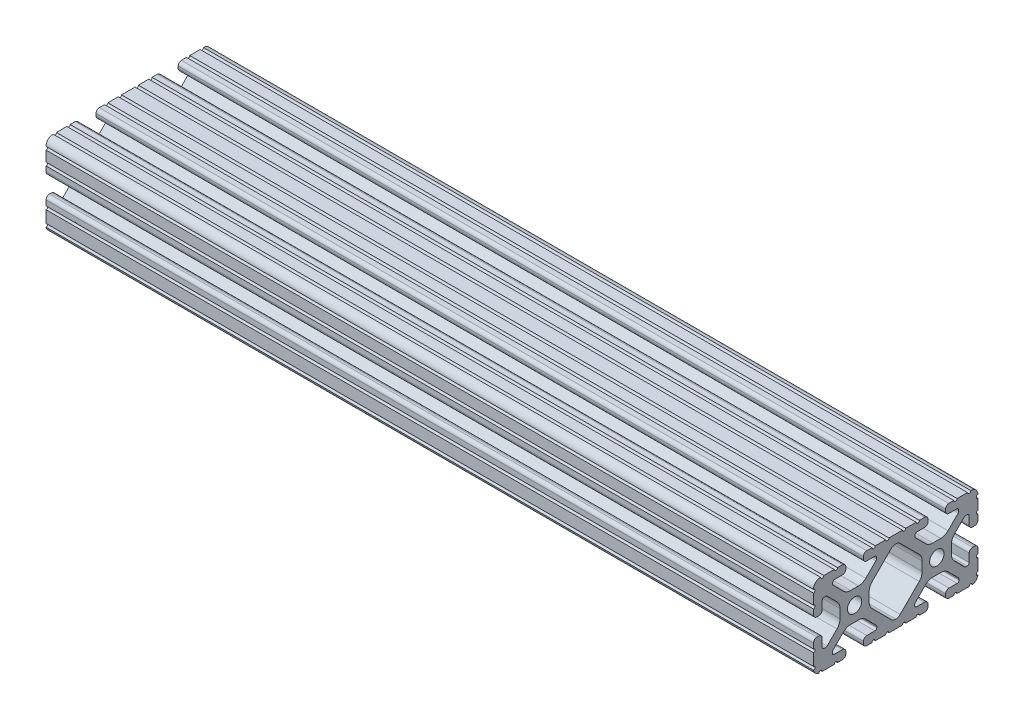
from build123d import *

# Parameters (mm, degrees)
SKETCH1_R      = 3.3274
EXTRUDE1_DEPTH = 355.6


with BuildPart() as part:
    # Sketch1 → Extrude1 (new body)
    with BuildSketch(Plane(origin=(0, 0, 0), x_dir=(0, 0, -1), z_dir=(1, 0, 0))):
        with BuildLine():
            Line((37.1900335, 54.320138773), (37.1900335, 54.882716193))
            ThreePointArc((37.1900335, 54.882716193), (37.450415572, 55.511334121), (38.0790335, 55.771716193))
            Line((38.0790335, 55.771716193), (41.685477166, 55.771716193))
            ThreePointArc((41.685477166, 55.771716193), (42.799028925, 56.232964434), (43.260277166, 57.346516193))
            Line((43.260277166, 57.346516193), (43.260277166, 58.282488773))
            ThreePointArc((43.260277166, 58.282488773), (42.805347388, 59.380786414), (41.707049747, 59.835716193))
            Line((41.707049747, 59.835716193), (39.271813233, 59.835716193))
            ThreePointArc((39.271813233, 59.835716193), (38.509813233, 59.073716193), (37.747813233, 59.835716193))
            Line((37.747813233, 59.835716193), (32.919398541, 59.835716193))
            ThreePointArc((32.919398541, 59.835716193), (32.157398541, 59.073716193), (31.395398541, 59.835716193))
            Line((31.395398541, 59.835716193), (25.153155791, 59.835716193))
            ThreePointArc((25.153155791, 59.835716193), (24.391155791, 59.073716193), (23.629155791, 59.835716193))
            Line((23.629155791, 59.835716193), (18.800741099, 59.835716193))
            ThreePointArc((18.800741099, 59.835716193), (18.038741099, 59.073716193), (17.276741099, 59.835716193))
            Line((17.276741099, 59.835716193), (14.841504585, 59.835716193))
            ThreePointArc((14.841504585, 59.835716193), (13.743206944, 59.380786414), (13.288277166, 58.282488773))
            Line((13.288277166, 58.282488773), (13.288277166, 57.346516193))
            ThreePointArc((13.288277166, 57.346516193), (13.749525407, 56.232964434), (14.863077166, 55.771716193))
            Line((14.863077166, 55.771716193), (18.469520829, 55.771716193))
            ThreePointArc((18.469520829, 55.771716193), (19.098138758, 55.511334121), (19.358520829, 54.882716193))
            Line((19.358520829, 54.882716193), (19.358520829, 54.320138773))
            ThreePointArc((19.358520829, 54.320138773), (19.290850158, 53.979934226), (19.098140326, 53.691522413))
            Line((19.098140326, 53.691522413), (14.421778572, 49.015137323))
            ThreePointArc((14.421778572, 49.015137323), (12.880829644, 47.985503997), (11.063154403, 47.623944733))
            Line((11.063154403, 47.623944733), (7.38539993, 47.623944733))
            ThreePointArc((7.38539993, 47.623944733), (5.567724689, 47.985503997), (4.026775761, 49.015137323))
            Line((4.026775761, 49.015137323), (-0.649585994, 53.691522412))
            ThreePointArc((-0.649585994, 53.691522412), (-0.842295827, 53.979934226), (-0.909966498, 54.320138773))
            Line((-0.909966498, 54.320138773), (-0.909966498, 54.882716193))
            ThreePointArc((-0.909966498, 54.882716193), (-0.649584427, 55.511334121), (-0.020966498, 55.771716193))
            Line((-0.020966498, 55.771716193), (3.585477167, 55.771716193))
            ThreePointArc((3.585477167, 55.771716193), (4.699028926, 56.232964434), (5.160277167, 57.346516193))
            Line((5.160277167, 57.346516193), (5.160277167, 58.266281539))
            ThreePointArc((5.160277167, 58.266281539), (4.744040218, 59.332924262), (3.715361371, 59.835716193))
            Line((3.715361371, 59.835716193), (1.328459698, 59.835716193))
            ThreePointArc((1.328459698, 59.835716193), (0.566459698, 59.073716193), (-0.195540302, 59.835716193))
            Line((-0.195540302, 59.835716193), (-5.021979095, 59.835716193))
            ThreePointArc((-5.021979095, 59.835716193), (-5.807035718, 59.097492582), (-6.545259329, 59.882549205))
            ThreePointArc((-6.545259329, 59.882549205), (-8.87374186, 58.977730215), (-9.863337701, 56.683993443))
            ThreePointArc((-9.863337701, 56.683993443), (-9.063955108, 55.941735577), (-9.825722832, 55.160922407))
            Line((-9.825722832, 55.160922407), (-9.825722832, 50.335417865))
            ThreePointArc((-9.825722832, 50.335417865), (-9.063722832, 49.573417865), (-9.825722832, 48.811417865))
            Line((-9.825722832, 48.811417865), (-9.825722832, 46.424516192))
            ThreePointArc((-9.825722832, 46.424516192), (-9.364474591, 45.310964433), (-8.250922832, 44.849716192))
            Line((-8.250922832, 44.849716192), (-7.336522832, 44.849716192))
            ThreePointArc((-7.336522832, 44.849716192), (-6.222971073, 45.310964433), (-5.761722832, 46.424516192))
            Line((-5.761722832, 46.424516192), (-5.761722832, 50.183716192))
            ThreePointArc((-5.761722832, 50.183716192), (-5.50134076, 50.81233412), (-4.872722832, 51.072716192))
            Line((-4.872722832, 51.072716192), (-4.146379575, 51.072716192))
            ThreePointArc((-4.146379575, 51.072716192), (-3.806172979, 51.005044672), (-3.517760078, 50.812332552))
            Line((-3.517760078, 50.812332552), (1.076701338, 46.217848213))
            ThreePointArc((1.076701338, 46.217848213), (2.10632244, 44.676905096), (2.467877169, 42.859240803))
            Line((2.467877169, 42.859240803), (2.467877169, 38.712191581))
            ThreePointArc((2.467877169, 38.712191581), (2.10632244, 36.894527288), (1.076701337, 35.353584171))
            Line((1.076701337, 35.353584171), (-3.517760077, 30.759099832))
            ThreePointArc((-3.517760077, 30.759099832), (-3.806172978, 30.566387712), (-4.146379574, 30.498716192))
            Line((-4.146379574, 30.498716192), (-4.872722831, 30.498716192))
            ThreePointArc((-4.872722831, 30.498716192), (-5.501340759, 30.759098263), (-5.761722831, 31.387716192))
            Line((-5.761722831, 31.387716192), (-5.761722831, 35.146916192))
            ThreePointArc((-5.761722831, 35.146916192), (-6.222971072, 36.260467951), (-7.336522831, 36.721716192))
            Line((-7.336522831, 36.721716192), (-8.250922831, 36.721716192))
            ThreePointArc((-8.250922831, 36.721716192), (-9.36447459, 36.260467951), (-9.825722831, 35.146916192))
            Line((-9.825722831, 35.146916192), (-9.825722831, 32.760014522))
            ThreePointArc((-9.825722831, 32.760014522), (-9.063722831, 31.998014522), (-9.825722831, 31.236014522))
            Line((-9.825722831, 31.236014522), (-9.825722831, 25.74969698))
            ThreePointArc((-9.825722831, 25.74969698), (-9.063722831, 24.98769698), (-9.825722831, 24.22569698))
            ThreePointArc((-9.825722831, 24.22569698), (-8.934545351, 22.601713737), (-7.296996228, 21.735716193))
            ThreePointArc((-7.296996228, 21.735716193), (-6.534996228, 22.497716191), (-5.77299623, 21.735716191))
            Line((-5.77299623, 21.735716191), (-0.195540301, 21.735716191))
            ThreePointArc((-0.195540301, 21.735716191), (0.566459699, 22.497716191), (1.328459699, 21.735716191))
            Line((1.328459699, 21.735716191), (3.585477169, 21.735716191))
            ThreePointArc((3.585477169, 21.735716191), (4.699028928, 22.196964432), (5.160277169, 23.310516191))
            Line((5.160277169, 23.310516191), (5.160277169, 24.224916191))
            ThreePointArc((5.160277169, 24.224916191), (4.699028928, 25.33846795), (3.585477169, 25.799716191))
            Line((3.585477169, 25.799716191), (-0.173722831, 25.799716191))
            ThreePointArc((-0.173722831, 25.799716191), (-0.80234076, 26.060098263), (-1.062722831, 26.688716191))
            Line((-1.062722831, 26.688716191), (-1.062722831, 27.098536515))
            ThreePointArc((-1.062722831, 27.098536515), (-0.99505216, 27.438741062), (-0.802342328, 27.727152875))
            Line((-0.802342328, 27.727152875), (4.026775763, 32.556295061))
            ThreePointArc((4.026775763, 32.556295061), (5.567724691, 33.585928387), (7.385399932, 33.947487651))
            Line((7.385399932, 33.947487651), (11.063154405, 33.947487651))
            ThreePointArc((11.063154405, 33.947487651), (12.880829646, 33.585928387), (14.421778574, 32.556295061))
            Line((14.421778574, 32.556295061), (19.250896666, 27.727152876))
            ThreePointArc((19.250896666, 27.727152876), (19.443606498, 27.438741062), (19.511277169, 27.098536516))
            Line((19.511277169, 27.098536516), (19.511277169, 26.688716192))
            ThreePointArc((19.511277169, 26.688716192), (19.250895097, 26.060098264), (18.622277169, 25.799716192))
            Line((18.622277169, 25.799716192), (14.863077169, 25.799716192))
            ThreePointArc((14.863077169, 25.799716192), (13.74952541, 25.338467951), (13.288277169, 24.224916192))
            Line((13.288277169, 24.224916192), (13.288277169, 23.310516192))
            ThreePointArc((13.288277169, 23.310516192), (13.74952541, 22.196964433), (14.863077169, 21.735716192))
            Line((14.863077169, 21.735716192), (17.276741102, 21.735716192))
            ThreePointArc((17.276741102, 21.735716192), (18.038741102, 22.497716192), (18.800741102, 21.735716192))
            Line((18.800741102, 21.735716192), (23.629155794, 21.735716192))
            ThreePointArc((23.629155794, 21.735716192), (24.391155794, 22.497716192), (25.153155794, 21.735716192))
            Line((25.153155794, 21.735716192), (31.395398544, 21.735716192))
            ThreePointArc((31.395398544, 21.735716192), (32.157398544, 22.497716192), (32.919398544, 21.735716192))
            Line((32.919398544, 21.735716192), (37.747813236, 21.735716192))
            ThreePointArc((37.747813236, 21.735716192), (38.509813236, 22.497716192), (39.271813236, 21.735716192))
            Line((39.271813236, 21.735716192), (41.685477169, 21.735716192))
            ThreePointArc((41.685477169, 21.735716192), (42.799028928, 22.196964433), (43.260277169, 23.310516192))
            Line((43.260277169, 23.310516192), (43.260277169, 24.224916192))
            ThreePointArc((43.260277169, 24.224916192), (42.799028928, 25.338467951), (41.685477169, 25.799716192))
            Line((41.685477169, 25.799716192), (37.926277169, 25.799716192))
            ThreePointArc((37.926277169, 25.799716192), (37.29765924, 26.060098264), (37.037277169, 26.688716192))
            Line((37.037277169, 26.688716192), (37.037277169, 27.098536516))
            ThreePointArc((37.037277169, 27.098536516), (37.10494784, 27.438741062), (37.297657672, 27.727152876))
            Line((37.297657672, 27.727152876), (42.126775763, 32.556295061))
            ThreePointArc((42.126775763, 32.556295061), (43.667724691, 33.585928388), (45.485399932, 33.947487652))
            Line((45.485399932, 33.947487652), (49.163154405, 33.947487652))
            ThreePointArc((49.163154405, 33.947487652), (50.980829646, 33.585928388), (52.521778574, 32.556295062))
            Line((52.521778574, 32.556295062), (57.350896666, 27.727152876))
            ThreePointArc((57.350896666, 27.727152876), (57.543606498, 27.438741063), (57.611277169, 27.098536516))
            Line((57.611277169, 27.098536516), (57.611277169, 26.688716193))
            ThreePointArc((57.611277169, 26.688716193), (57.350895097, 26.060098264), (56.722277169, 25.799716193))
            Line((56.722277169, 25.799716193), (52.963077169, 25.799716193))
            ThreePointArc((52.963077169, 25.799716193), (51.84952541, 25.338467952), (51.388277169, 24.224916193))
            Line((51.388277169, 24.224916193), (51.388277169, 23.310516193))
            ThreePointArc((51.388277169, 23.310516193), (51.84952541, 22.196964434), (52.963077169, 21.735716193))
            Line((52.963077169, 21.735716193), (55.220094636, 21.735716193))
            ThreePointArc((55.220094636, 21.735716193), (55.982094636, 22.497716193), (56.744094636, 21.735716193))
            Line((56.744094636, 21.735716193), (62.321550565, 21.735716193))
            ThreePointArc((62.321550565, 21.735716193), (63.083550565, 22.497716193), (63.845550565, 21.735716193))
            ThreePointArc((63.845550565, 21.735716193), (65.481854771, 22.602978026), (66.374277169, 24.225696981))
            ThreePointArc((66.374277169, 24.225696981), (65.612277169, 24.987696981), (66.374277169, 25.749696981))
            Line((66.374277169, 25.749696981), (66.374277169, 31.236014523))
            ThreePointArc((66.374277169, 31.236014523), (65.612277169, 31.998014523), (66.374277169, 32.760014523))
            Line((66.374277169, 32.760014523), (66.374277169, 35.146916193))
            ThreePointArc((66.374277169, 35.146916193), (65.913028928, 36.260467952), (64.799477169, 36.721716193))
            Line((64.799477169, 36.721716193), (63.885077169, 36.721716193))
            ThreePointArc((63.885077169, 36.721716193), (62.77152541, 36.260467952), (62.310277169, 35.146916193))
            Line((62.310277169, 35.146916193), (62.310277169, 31.387716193))
            ThreePointArc((62.310277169, 31.387716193), (62.049895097, 30.759098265), (61.421277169, 30.498716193))
            Line((61.421277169, 30.498716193), (60.694933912, 30.498716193))
            ThreePointArc((60.694933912, 30.498716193), (60.354727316, 30.566387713), (60.066314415, 30.759099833))
            Line((60.066314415, 30.759099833), (55.471853, 35.353584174))
            ThreePointArc((55.471853, 35.353584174), (54.442231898, 36.894527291), (54.08067717, 38.712191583))
            Line((54.08067717, 38.712191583), (54.08067717, 42.859240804))
            ThreePointArc((54.08067717, 42.859240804), (54.442231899, 44.676905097), (55.471853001, 46.217848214))
            Line((55.471853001, 46.217848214), (60.066314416, 50.812332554))
            ThreePointArc((60.066314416, 50.812332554), (60.354727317, 51.005044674), (60.694933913, 51.072716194))
            Line((60.694933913, 51.072716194), (61.42127717, 51.072716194))
            ThreePointArc((61.42127717, 51.072716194), (62.049895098, 50.812334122), (62.31027717, 50.183716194))
            Line((62.31027717, 50.183716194), (62.31027717, 46.424516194))
            ThreePointArc((62.31027717, 46.424516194), (62.771525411, 45.310964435), (63.88507717, 44.849716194))
            Line((63.88507717, 44.849716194), (64.79947717, 44.849716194))
            ThreePointArc((64.79947717, 44.849716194), (65.913028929, 45.310964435), (66.37427717, 46.424516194))
            Line((66.37427717, 46.424516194), (66.37427717, 48.811417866))
            ThreePointArc((66.37427717, 48.811417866), (65.61227717, 49.573417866), (66.37427717, 50.335417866))
            Line((66.37427717, 50.335417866), (66.37427717, 55.160922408))
            ThreePointArc((66.37427717, 55.160922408), (65.612509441, 55.941735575), (66.411892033, 56.683993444))
            ThreePointArc((66.411892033, 56.683993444), (65.422296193, 58.977730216), (63.093813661, 59.882549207))
            ThreePointArc((63.093813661, 59.882549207), (62.355590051, 59.097492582), (61.570533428, 59.835716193))
            Line((61.570533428, 59.835716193), (56.744094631, 59.835716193))
            ThreePointArc((56.744094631, 59.835716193), (55.982094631, 59.073716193), (55.220094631, 59.835716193))
            Line((55.220094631, 59.835716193), (52.833192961, 59.835716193))
            ThreePointArc((52.833192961, 59.835716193), (51.804514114, 59.332924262), (51.388277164, 58.266281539))
            Line((51.388277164, 58.266281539), (51.388277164, 57.346516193))
            ThreePointArc((51.388277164, 57.346516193), (51.849525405, 56.232964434), (52.963077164, 55.771716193))
            Line((52.963077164, 55.771716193), (56.569520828, 55.771716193))
            ThreePointArc((56.569520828, 55.771716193), (57.198138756, 55.511334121), (57.458520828, 54.882716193))
            Line((57.458520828, 54.882716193), (57.458520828, 54.320138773))
            ThreePointArc((57.458520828, 54.320138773), (57.390850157, 53.979934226), (57.198140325, 53.691522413))
            Line((57.198140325, 53.691522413), (52.52177857, 49.015137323))
            ThreePointArc((52.52177857, 49.015137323), (50.980829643, 47.985503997), (49.163154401, 47.623944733))
            Line((49.163154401, 47.623944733), (45.485399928, 47.623944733))
            ThreePointArc((45.485399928, 47.623944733), (43.667724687, 47.985503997), (42.12677576, 49.015137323))
            Line((42.12677576, 49.015137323), (37.450414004, 53.691522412))
            ThreePointArc((37.450414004, 53.691522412), (37.257704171, 53.979934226), (37.1900335, 54.320138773))
        make_face()
        with Locations((47.324277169, 40.785716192)):
            Circle(SKETCH1_R, mode=Mode.SUBTRACT)
        with Locations((9.224277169, 40.785716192)):
            Circle(SKETCH1_R, mode=Mode.SUBTRACT)
        with BuildLine():
            Line((30.35131253, 26.52815133), (39.176701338, 35.353584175))
            ThreePointArc((39.176701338, 35.353584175), (40.206322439, 36.894527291), (40.567877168, 38.712191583))
            Line((40.567877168, 38.712191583), (40.567877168, 42.859240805))
            ThreePointArc((40.567877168, 42.859240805), (40.206322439, 44.676905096), (39.176701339, 46.217848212))
            Line((39.176701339, 46.217848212), (30.35131253, 55.043281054))
            ThreePointArc((30.35131253, 55.043281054), (29.39832277, 55.678689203), (28.274277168, 55.898812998))
            ThreePointArc((28.274277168, 55.898812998), (27.150231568, 55.678689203), (26.197241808, 55.043281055))
            Line((26.197241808, 55.043281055), (17.371853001, 46.217848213))
            ThreePointArc((17.371853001, 46.217848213), (16.342231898, 44.676905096), (15.980677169, 42.859240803))
            Line((15.980677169, 42.859240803), (15.980677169, 38.712191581))
            ThreePointArc((15.980677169, 38.712191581), (16.342231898, 36.894527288), (17.371853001, 35.353584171))
            Line((17.371853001, 35.353584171), (26.197241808, 26.528151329))
            ThreePointArc((26.197241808, 26.528151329), (27.150231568, 25.892743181), (28.274277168, 25.672619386))
            ThreePointArc((28.274277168, 25.672619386), (29.39832277, 25.892743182), (30.35131253, 26.52815133))
        make_face(mode=Mode.SUBTRACT)
    extrude(amount=EXTRUDE1_DEPTH)


solid = part.part
